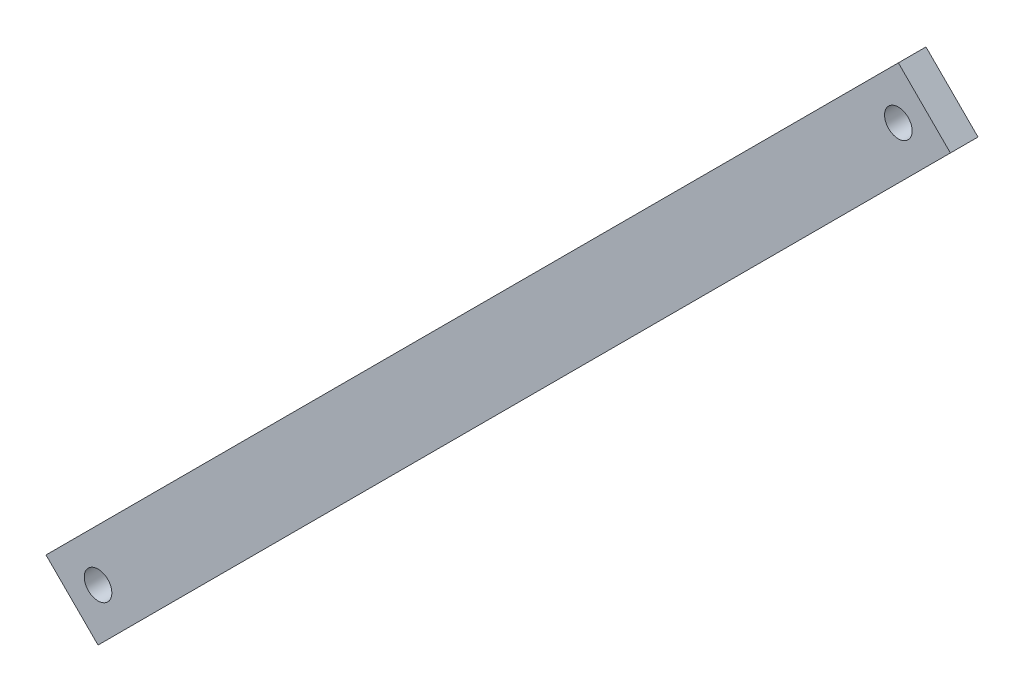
from build123d import *

# Parameters (mm, degrees)
ESQUISSE1_R      = 1.5
EXTRUSION1_DEPTH = 3


with BuildPart() as part:
    # Esquisse1 → Extrusion1 (new body)
    with BuildSketch(Plane.XY):
        Polygon((0, -5.656854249), (92.656854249, 87), (87, 92.656854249), (-5.656854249, 0), align=None)
        Circle(ESQUISSE1_R, mode=Mode.SUBTRACT)
        with Locations((87, 87)):
            Circle(ESQUISSE1_R, mode=Mode.SUBTRACT)
    extrude(amount=EXTRUSION1_DEPTH)


solid = part.part
